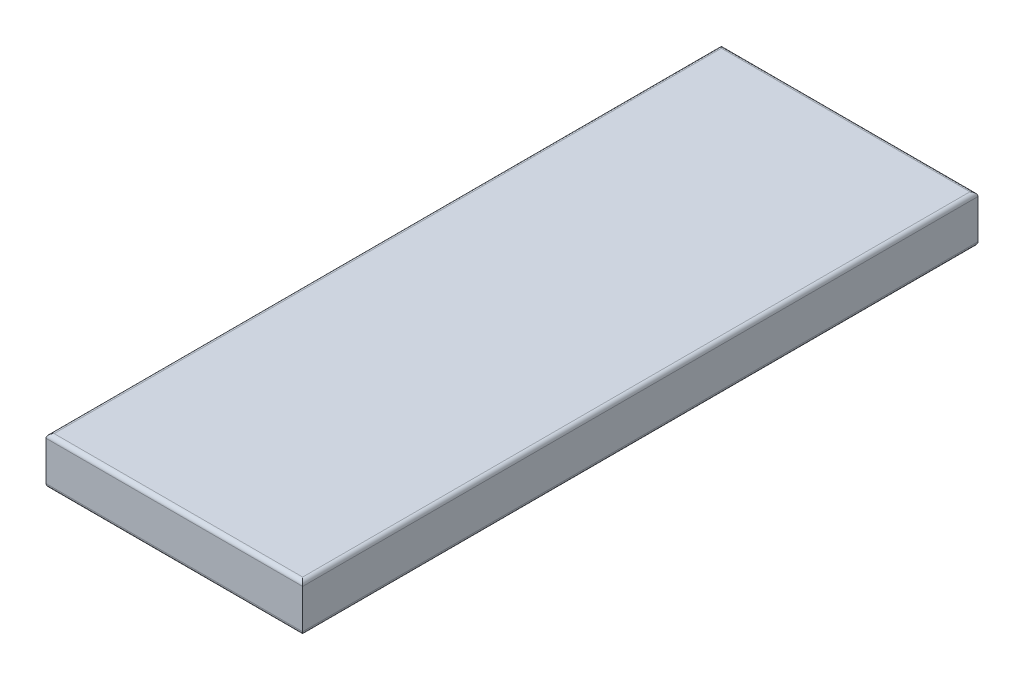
from build123d import *

# Parameters (mm, degrees)
SKETCH_1_W      = 19
SKETCH_1_H      = 3.5
EXTRUDE_1_DEPTH = 50
FILLET_1_R      = 0.3


with BuildPart() as part:
    # Sketch 1 → Extrude 1 (new body)
    with BuildSketch(Plane.XY):
        Rectangle(SKETCH_1_W, SKETCH_1_H)
    extrude(amount=EXTRUDE_1_DEPTH)

    # Fillet 1
    fillet_1_edges = [part.edges().sort_by_distance(p)[0] for p in [
        (0, -1.75, 50),
        (0, -1.75, 0),
        (0, 1.75, 0),
        (0, 1.75, 50),
        (9.5, -1.75, 25),
        (-9.5, -1.75, 25),
        (-9.5, 1.75, 25),
        (9.5, 1.75, 25),
    ]]
    fillet(fillet_1_edges, radius=FILLET_1_R)


solid = part.part
